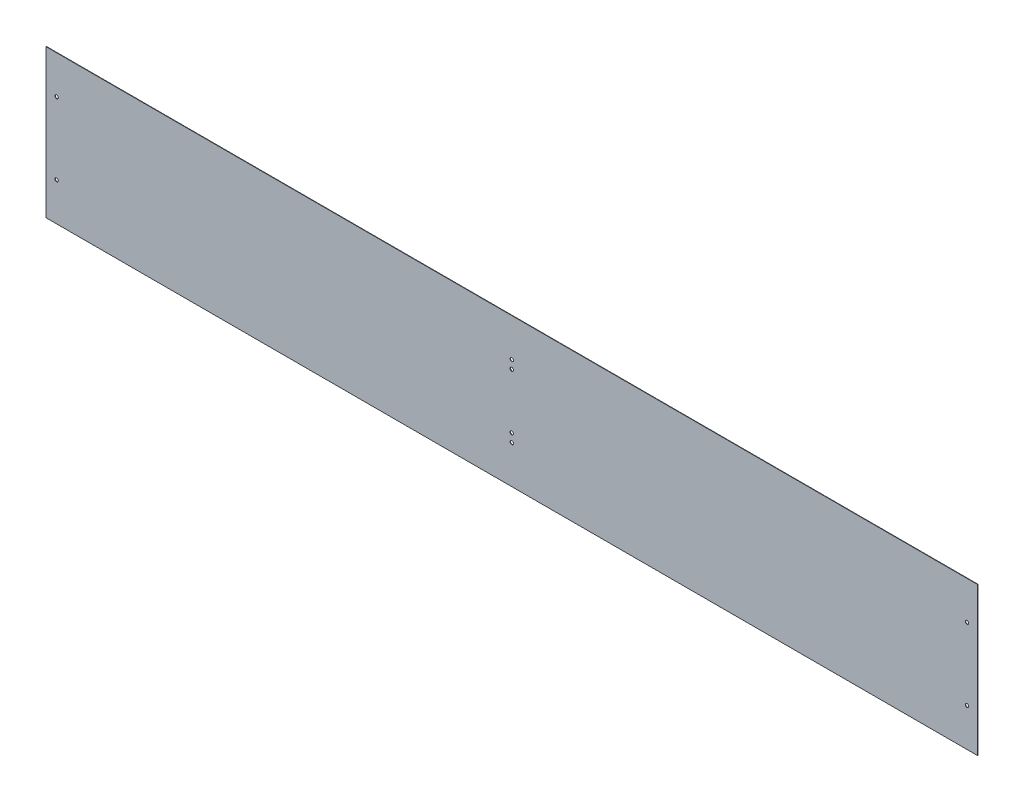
ISO-10303-21;
HEADER;
FILE_DESCRIPTION(('STEP AP214'),'2;1');
FILE_NAME('part.step','',(''),(''),'','','');
FILE_SCHEMA(('AUTOMOTIVE_DESIGN { 1 0 10303 214 1 1 1 1 }'));
ENDSEC;
DATA;
#1=APPLICATION_CONTEXT('core data for automotive mechanical design processes');
#2=APPLICATION_PROTOCOL_DEFINITION('international standard','automotive_design',2000,#1);
#3=PRODUCT_CONTEXT('',#1,'mechanical');
#4=PRODUCT('Part','Part','',(#3));
#5=PRODUCT_RELATED_PRODUCT_CATEGORY('part','',(#4));
#6=PRODUCT_DEFINITION_FORMATION('','',#4);
#7=PRODUCT_DEFINITION_CONTEXT('part definition',#1,'design');
#8=PRODUCT_DEFINITION('design','',#6,#7);
#9=PRODUCT_DEFINITION_SHAPE('','',#8);
#10=(LENGTH_UNIT() NAMED_UNIT(*) SI_UNIT(.MILLI.,.METRE.));
#11=(NAMED_UNIT(*) PLANE_ANGLE_UNIT() SI_UNIT($,.RADIAN.));
#12=(NAMED_UNIT(*) SI_UNIT($,.STERADIAN.) SOLID_ANGLE_UNIT());
#13=UNCERTAINTY_MEASURE_WITH_UNIT(LENGTH_MEASURE(1.E-05),#10,'distance_accuracy_value','');
#14=(GEOMETRIC_REPRESENTATION_CONTEXT(3) GLOBAL_UNCERTAINTY_ASSIGNED_CONTEXT((#13)) GLOBAL_UNIT_ASSIGNED_CONTEXT((#10,
#11,#12)) REPRESENTATION_CONTEXT('',''));
#15=CARTESIAN_POINT('',(0.,0.,0.));
#16=DIRECTION('',(0.,0.,1.));
#17=DIRECTION('',(1.,0.,0.));
#18=AXIS2_PLACEMENT_3D('',#15,#16,#17);
#19=CARTESIAN_POINT('',(220.,70.,-0.099999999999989));
#20=DIRECTION('',(-1.,0.,0.));
#21=DIRECTION('',(0.,0.,1.));
#22=AXIS2_PLACEMENT_3D('',#19,#20,#21);
#23=PLANE('',#22);
#24=DIRECTION('',(0.,0.,-1.));
#25=VECTOR('',#24,1.);
#26=CARTESIAN_POINT('',(220.,0.,-0.099999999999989));
#27=LINE('',#26,#25);
#28=CARTESIAN_POINT('',(220.,0.,0.099999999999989));
#29=VERTEX_POINT('',#28);
#30=CARTESIAN_POINT('',(220.,0.,-0.099999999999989));
#31=VERTEX_POINT('',#30);
#32=EDGE_CURVE('E107',#29,#31,#27,.T.);
#33=ORIENTED_EDGE('',*,*,#32,.T.);
#34=DIRECTION('',(0.,-1.,0.));
#35=VECTOR('',#34,1.);
#36=CARTESIAN_POINT('',(220.,70.,-0.099999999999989));
#37=LINE('',#36,#35);
#38=CARTESIAN_POINT('',(220.,70.,-0.099999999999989));
#39=VERTEX_POINT('',#38);
#40=EDGE_CURVE('E11',#39,#31,#37,.T.);
#41=ORIENTED_EDGE('',*,*,#40,.F.);
#42=DIRECTION('',(0.,0.,-1.));
#43=VECTOR('',#42,1.);
#44=CARTESIAN_POINT('',(220.,70.,-0.099999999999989));
#45=LINE('',#44,#43);
#46=CARTESIAN_POINT('',(220.,70.,0.099999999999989));
#47=VERTEX_POINT('',#46);
#48=EDGE_CURVE('E91',#47,#39,#45,.T.);
#49=ORIENTED_EDGE('',*,*,#48,.F.);
#50=DIRECTION('',(0.,-1.,0.));
#51=VECTOR('',#50,1.);
#52=CARTESIAN_POINT('',(220.,70.,0.099999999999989));
#53=LINE('',#52,#51);
#54=EDGE_CURVE('E103',#47,#29,#53,.T.);
#55=ORIENTED_EDGE('',*,*,#54,.T.);
#56=EDGE_LOOP('',(#33,#41,#49,#55));
#57=FACE_BOUND('',#56,.T.);
#58=ADVANCED_FACE('F39',(#57),#23,.F.);
#59=CARTESIAN_POINT('',(-220.,70.,-0.099999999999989));
#60=DIRECTION('',(0.,0.,1.));
#61=DIRECTION('',(1.,0.,0.));
#62=AXIS2_PLACEMENT_3D('',#59,#60,#61);
#63=PLANE('',#62);
#64=CARTESIAN_POINT('',(215.,52.,-0.099999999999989));
#65=DIRECTION('',(0.,0.,-1.));
#66=DIRECTION('',(-1.,0.,0.));
#67=AXIS2_PLACEMENT_3D('',#64,#65,#66);
#68=CIRCLE('',#67,0.799999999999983);
#69=CARTESIAN_POINT('',(214.2,52.,-0.099999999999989));
#70=VERTEX_POINT('',#69);
#71=EDGE_CURVE('E161',#70,#70,#68,.T.);
#72=ORIENTED_EDGE('',*,*,#71,.F.);
#73=EDGE_LOOP('',(#72));
#74=FACE_BOUND('',#73,.T.);
#75=CARTESIAN_POINT('',(0.,52.,-0.099999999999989));
#76=DIRECTION('',(0.,0.,-1.));
#77=DIRECTION('',(-1.,0.,0.));
#78=AXIS2_PLACEMENT_3D('',#75,#76,#77);
#79=CIRCLE('',#78,0.800000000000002);
#80=CARTESIAN_POINT('',(-0.800000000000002,52.,-0.099999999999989));
#81=VERTEX_POINT('',#80);
#82=EDGE_CURVE('E153',#81,#81,#79,.T.);
#83=ORIENTED_EDGE('',*,*,#82,.F.);
#84=EDGE_LOOP('',(#83));
#85=FACE_BOUND('',#84,.T.);
#86=CARTESIAN_POINT('',(0.,22.,-0.099999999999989));
#87=DIRECTION('',(0.,0.,-1.));
#88=DIRECTION('',(-1.,0.,0.));
#89=AXIS2_PLACEMENT_3D('',#86,#87,#88);
#90=CIRCLE('',#89,0.8);
#91=CARTESIAN_POINT('',(-0.8,22.,-0.099999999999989));
#92=VERTEX_POINT('',#91);
#93=EDGE_CURVE('E145',#92,#92,#90,.T.);
#94=ORIENTED_EDGE('',*,*,#93,.F.);
#95=EDGE_LOOP('',(#94));
#96=FACE_BOUND('',#95,.T.);
#97=CARTESIAN_POINT('',(0.,18.,-0.099999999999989));
#98=DIRECTION('',(0.,0.,-1.));
#99=DIRECTION('',(-1.,0.,0.));
#100=AXIS2_PLACEMENT_3D('',#97,#98,#99);
#101=CIRCLE('',#100,0.799999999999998);
#102=CARTESIAN_POINT('',(-0.799999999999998,18.,-0.099999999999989));
#103=VERTEX_POINT('',#102);
#104=EDGE_CURVE('E136',#103,#103,#101,.T.);
#105=ORIENTED_EDGE('',*,*,#104,.F.);
#106=EDGE_LOOP('',(#105));
#107=FACE_BOUND('',#106,.T.);
#108=CARTESIAN_POINT('',(0.,48.,-0.099999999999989));
#109=DIRECTION('',(0.,0.,-1.));
#110=DIRECTION('',(-1.,0.,0.));
#111=AXIS2_PLACEMENT_3D('',#108,#109,#110);
#112=CIRCLE('',#111,0.800000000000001);
#113=CARTESIAN_POINT('',(-0.800000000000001,48.,-0.099999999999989));
#114=VERTEX_POINT('',#113);
#115=EDGE_CURVE('E184',#114,#114,#112,.T.);
#116=ORIENTED_EDGE('',*,*,#115,.F.);
#117=EDGE_LOOP('',(#116));
#118=FACE_BOUND('',#117,.T.);
#119=CARTESIAN_POINT('',(-215.,18.,-0.099999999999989));
#120=DIRECTION('',(0.,0.,-1.));
#121=DIRECTION('',(1.,0.,0.));
#122=AXIS2_PLACEMENT_3D('',#119,#120,#121);
#123=CIRCLE('',#122,0.799999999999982);
#124=CARTESIAN_POINT('',(-215.8,18.,-0.099999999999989));
#125=VERTEX_POINT('',#124);
#126=EDGE_CURVE('E176',#125,#125,#123,.T.);
#127=ORIENTED_EDGE('',*,*,#126,.F.);
#128=EDGE_LOOP('',(#127));
#129=FACE_BOUND('',#128,.T.);
#130=CARTESIAN_POINT('',(-215.,52.,-0.099999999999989));
#131=DIRECTION('',(0.,0.,-1.));
#132=DIRECTION('',(1.,0.,0.));
#133=AXIS2_PLACEMENT_3D('',#130,#131,#132);
#134=CIRCLE('',#133,0.799999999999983);
#135=CARTESIAN_POINT('',(-215.8,52.,-0.099999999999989));
#136=VERTEX_POINT('',#135);
#137=EDGE_CURVE('E168',#136,#136,#134,.T.);
#138=ORIENTED_EDGE('',*,*,#137,.F.);
#139=EDGE_LOOP('',(#138));
#140=FACE_BOUND('',#139,.T.);
#141=CARTESIAN_POINT('',(215.,18.,-0.099999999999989));
#142=DIRECTION('',(0.,0.,-1.));
#143=DIRECTION('',(-1.,0.,0.));
#144=AXIS2_PLACEMENT_3D('',#141,#142,#143);
#145=CIRCLE('',#144,0.799999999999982);
#146=CARTESIAN_POINT('',(214.2,18.,-0.099999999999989));
#147=VERTEX_POINT('',#146);
#148=EDGE_CURVE('E128',#147,#147,#145,.T.);
#149=ORIENTED_EDGE('',*,*,#148,.F.);
#150=EDGE_LOOP('',(#149));
#151=FACE_BOUND('',#150,.T.);
#152=DIRECTION('',(-1.,0.,0.));
#153=VECTOR('',#152,1.);
#154=CARTESIAN_POINT('',(-220.,0.,-0.099999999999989));
#155=LINE('',#154,#153);
#156=CARTESIAN_POINT('',(-220.,0.,-0.099999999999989));
#157=VERTEX_POINT('',#156);
#158=EDGE_CURVE('E96',#31,#157,#155,.T.);
#159=ORIENTED_EDGE('',*,*,#158,.T.);
#160=DIRECTION('',(0.,-1.,0.));
#161=VECTOR('',#160,1.);
#162=CARTESIAN_POINT('',(-220.,70.,-0.099999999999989));
#163=LINE('',#162,#161);
#164=CARTESIAN_POINT('',(-220.,70.,-0.099999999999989));
#165=VERTEX_POINT('',#164);
#166=EDGE_CURVE('E48',#165,#157,#163,.T.);
#167=ORIENTED_EDGE('',*,*,#166,.F.);
#168=DIRECTION('',(-1.,0.,0.));
#169=VECTOR('',#168,1.);
#170=CARTESIAN_POINT('',(-220.,70.,-0.099999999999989));
#171=LINE('',#170,#169);
#172=EDGE_CURVE('E86',#39,#165,#171,.T.);
#173=ORIENTED_EDGE('',*,*,#172,.F.);
#174=ORIENTED_EDGE('',*,*,#40,.T.);
#175=EDGE_LOOP('',(#159,#167,#173,#174));
#176=FACE_BOUND('',#175,.T.);
#177=ADVANCED_FACE('F95',(#74,#85,#96,#107,#118,#129,#140,#151,#176),#63,.F.);
#178=CARTESIAN_POINT('',(-220.,70.,-0.099999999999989));
#179=DIRECTION('',(1.,0.,0.));
#180=DIRECTION('',(0.,0.,-1.));
#181=AXIS2_PLACEMENT_3D('',#178,#179,#180);
#182=PLANE('',#181);
#183=DIRECTION('',(0.,0.,1.));
#184=VECTOR('',#183,1.);
#185=CARTESIAN_POINT('',(-220.,0.,-0.099999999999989));
#186=LINE('',#185,#184);
#187=CARTESIAN_POINT('',(-220.,0.,0.099999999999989));
#188=VERTEX_POINT('',#187);
#189=EDGE_CURVE('E73',#157,#188,#186,.T.);
#190=ORIENTED_EDGE('',*,*,#189,.T.);
#191=DIRECTION('',(0.,-1.,0.));
#192=VECTOR('',#191,1.);
#193=CARTESIAN_POINT('',(-220.,70.,0.099999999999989));
#194=LINE('',#193,#192);
#195=CARTESIAN_POINT('',(-220.,70.,0.099999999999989));
#196=VERTEX_POINT('',#195);
#197=EDGE_CURVE('E98',#196,#188,#194,.T.);
#198=ORIENTED_EDGE('',*,*,#197,.F.);
#199=DIRECTION('',(0.,0.,1.));
#200=VECTOR('',#199,1.);
#201=CARTESIAN_POINT('',(-220.,70.,-0.099999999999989));
#202=LINE('',#201,#200);
#203=EDGE_CURVE('E89',#165,#196,#202,.T.);
#204=ORIENTED_EDGE('',*,*,#203,.F.);
#205=ORIENTED_EDGE('',*,*,#166,.T.);
#206=EDGE_LOOP('',(#190,#198,#204,#205));
#207=FACE_BOUND('',#206,.T.);
#208=ADVANCED_FACE('F99',(#207),#182,.F.);
#209=CARTESIAN_POINT('',(-220.,70.,0.099999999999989));
#210=DIRECTION('',(0.,0.,-1.));
#211=DIRECTION('',(-1.,0.,0.));
#212=AXIS2_PLACEMENT_3D('',#209,#210,#211);
#213=PLANE('',#212);
#214=CARTESIAN_POINT('',(215.,52.,0.099999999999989));
#215=DIRECTION('',(0.,0.,-1.));
#216=DIRECTION('',(-1.,0.,0.));
#217=AXIS2_PLACEMENT_3D('',#214,#215,#216);
#218=CIRCLE('',#217,0.799999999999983);
#219=CARTESIAN_POINT('',(214.2,52.,0.099999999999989));
#220=VERTEX_POINT('',#219);
#221=EDGE_CURVE('E132',#220,#220,#218,.T.);
#222=ORIENTED_EDGE('',*,*,#221,.T.);
#223=EDGE_LOOP('',(#222));
#224=FACE_BOUND('',#223,.T.);
#225=CARTESIAN_POINT('',(0.,52.,0.099999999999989));
#226=DIRECTION('',(0.,0.,-1.));
#227=DIRECTION('',(-1.,0.,0.));
#228=AXIS2_PLACEMENT_3D('',#225,#226,#227);
#229=CIRCLE('',#228,0.800000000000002);
#230=CARTESIAN_POINT('',(-0.800000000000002,52.,0.099999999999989));
#231=VERTEX_POINT('',#230);
#232=EDGE_CURVE('E157',#231,#231,#229,.T.);
#233=ORIENTED_EDGE('',*,*,#232,.T.);
#234=EDGE_LOOP('',(#233));
#235=FACE_BOUND('',#234,.T.);
#236=CARTESIAN_POINT('',(0.,22.,0.099999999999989));
#237=DIRECTION('',(0.,0.,-1.));
#238=DIRECTION('',(-1.,0.,0.));
#239=AXIS2_PLACEMENT_3D('',#236,#237,#238);
#240=CIRCLE('',#239,0.8);
#241=CARTESIAN_POINT('',(-0.8,22.,0.099999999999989));
#242=VERTEX_POINT('',#241);
#243=EDGE_CURVE('E149',#242,#242,#240,.T.);
#244=ORIENTED_EDGE('',*,*,#243,.T.);
#245=EDGE_LOOP('',(#244));
#246=FACE_BOUND('',#245,.T.);
#247=CARTESIAN_POINT('',(0.,18.,0.099999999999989));
#248=DIRECTION('',(0.,0.,-1.));
#249=DIRECTION('',(-1.,0.,0.));
#250=AXIS2_PLACEMENT_3D('',#247,#248,#249);
#251=CIRCLE('',#250,0.799999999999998);
#252=CARTESIAN_POINT('',(-0.799999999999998,18.,0.099999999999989));
#253=VERTEX_POINT('',#252);
#254=EDGE_CURVE('E140',#253,#253,#251,.T.);
#255=ORIENTED_EDGE('',*,*,#254,.T.);
#256=EDGE_LOOP('',(#255));
#257=FACE_BOUND('',#256,.T.);
#258=CARTESIAN_POINT('',(0.,48.,0.099999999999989));
#259=DIRECTION('',(0.,0.,-1.));
#260=DIRECTION('',(-1.,0.,0.));
#261=AXIS2_PLACEMENT_3D('',#258,#259,#260);
#262=CIRCLE('',#261,0.800000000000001);
#263=CARTESIAN_POINT('',(-0.800000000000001,48.,0.099999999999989));
#264=VERTEX_POINT('',#263);
#265=EDGE_CURVE('E141',#264,#264,#262,.T.);
#266=ORIENTED_EDGE('',*,*,#265,.T.);
#267=EDGE_LOOP('',(#266));
#268=FACE_BOUND('',#267,.T.);
#269=CARTESIAN_POINT('',(-215.,18.,0.099999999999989));
#270=DIRECTION('',(0.,0.,-1.));
#271=DIRECTION('',(1.,0.,0.));
#272=AXIS2_PLACEMENT_3D('',#269,#270,#271);
#273=CIRCLE('',#272,0.799999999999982);
#274=CARTESIAN_POINT('',(-215.8,18.,0.099999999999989));
#275=VERTEX_POINT('',#274);
#276=EDGE_CURVE('E180',#275,#275,#273,.T.);
#277=ORIENTED_EDGE('',*,*,#276,.T.);
#278=EDGE_LOOP('',(#277));
#279=FACE_BOUND('',#278,.T.);
#280=CARTESIAN_POINT('',(-215.,52.,0.099999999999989));
#281=DIRECTION('',(0.,0.,-1.));
#282=DIRECTION('',(1.,0.,0.));
#283=AXIS2_PLACEMENT_3D('',#280,#281,#282);
#284=CIRCLE('',#283,0.799999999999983);
#285=CARTESIAN_POINT('',(-215.8,52.,0.099999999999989));
#286=VERTEX_POINT('',#285);
#287=EDGE_CURVE('E172',#286,#286,#284,.T.);
#288=ORIENTED_EDGE('',*,*,#287,.T.);
#289=EDGE_LOOP('',(#288));
#290=FACE_BOUND('',#289,.T.);
#291=CARTESIAN_POINT('',(215.,18.,0.099999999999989));
#292=DIRECTION('',(0.,0.,-1.));
#293=DIRECTION('',(-1.,0.,0.));
#294=AXIS2_PLACEMENT_3D('',#291,#292,#293);
#295=CIRCLE('',#294,0.799999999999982);
#296=CARTESIAN_POINT('',(214.2,18.,0.099999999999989));
#297=VERTEX_POINT('',#296);
#298=EDGE_CURVE('E111',#297,#297,#295,.T.);
#299=ORIENTED_EDGE('',*,*,#298,.T.);
#300=EDGE_LOOP('',(#299));
#301=FACE_BOUND('',#300,.T.);
#302=DIRECTION('',(1.,0.,0.));
#303=VECTOR('',#302,1.);
#304=CARTESIAN_POINT('',(-220.,0.,0.099999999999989));
#305=LINE('',#304,#303);
#306=EDGE_CURVE('E79',#188,#29,#305,.T.);
#307=ORIENTED_EDGE('',*,*,#306,.T.);
#308=ORIENTED_EDGE('',*,*,#54,.F.);
#309=DIRECTION('',(1.,0.,0.));
#310=VECTOR('',#309,1.);
#311=CARTESIAN_POINT('',(-220.,70.,0.099999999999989));
#312=LINE('',#311,#310);
#313=EDGE_CURVE('E56',#196,#47,#312,.T.);
#314=ORIENTED_EDGE('',*,*,#313,.F.);
#315=ORIENTED_EDGE('',*,*,#197,.T.);
#316=EDGE_LOOP('',(#307,#308,#314,#315));
#317=FACE_BOUND('',#316,.T.);
#318=ADVANCED_FACE('F121',(#224,#235,#246,#257,#268,#279,#290,#301,#317),#213,.F.);
#319=CARTESIAN_POINT('',(0.,70.,0.));
#320=DIRECTION('',(0.,1.,0.));
#321=DIRECTION('',(0.,0.,1.));
#322=AXIS2_PLACEMENT_3D('',#319,#320,#321);
#323=PLANE('',#322);
#324=ORIENTED_EDGE('',*,*,#48,.T.);
#325=ORIENTED_EDGE('',*,*,#172,.T.);
#326=ORIENTED_EDGE('',*,*,#203,.T.);
#327=ORIENTED_EDGE('',*,*,#313,.T.);
#328=EDGE_LOOP('',(#324,#325,#326,#327));
#329=FACE_BOUND('',#328,.T.);
#330=ADVANCED_FACE('F87',(#329),#323,.T.);
#331=CARTESIAN_POINT('',(0.,0.,0.));
#332=DIRECTION('',(0.,1.,0.));
#333=DIRECTION('',(0.,0.,1.));
#334=AXIS2_PLACEMENT_3D('',#331,#332,#333);
#335=PLANE('',#334);
#336=ORIENTED_EDGE('',*,*,#32,.F.);
#337=ORIENTED_EDGE('',*,*,#306,.F.);
#338=ORIENTED_EDGE('',*,*,#189,.F.);
#339=ORIENTED_EDGE('',*,*,#158,.F.);
#340=EDGE_LOOP('',(#336,#337,#338,#339));
#341=FACE_BOUND('',#340,.T.);
#342=ADVANCED_FACE('F124',(#341),#335,.F.);
#343=CARTESIAN_POINT('',(215.,18.,0.099999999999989));
#344=DIRECTION('',(0.,0.,-1.));
#345=DIRECTION('',(-1.,0.,0.));
#346=AXIS2_PLACEMENT_3D('',#343,#344,#345);
#347=CYLINDRICAL_SURFACE('',#346,0.799999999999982);
#348=CARTESIAN_POINT('',(214.2,18.,0.099999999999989));
#349=CARTESIAN_POINT('',(214.2,18.,0.0979166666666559));
#350=CARTESIAN_POINT('',(214.2,18.,0.0958333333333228));
#351=CARTESIAN_POINT('',(214.2,18.,0.0916666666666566));
#352=CARTESIAN_POINT('',(214.2,18.,0.0895833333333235));
#353=CARTESIAN_POINT('',(214.2,18.,0.0854166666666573));
#354=CARTESIAN_POINT('',(214.2,18.,0.0833333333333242));
#355=CARTESIAN_POINT('',(214.2,18.,0.079166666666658));
#356=CARTESIAN_POINT('',(214.2,18.,0.0770833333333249));
#357=CARTESIAN_POINT('',(214.2,18.,0.0729166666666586));
#358=CARTESIAN_POINT('',(214.2,18.,0.0708333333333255));
#359=CARTESIAN_POINT('',(214.2,18.,0.0666666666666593));
#360=CARTESIAN_POINT('',(214.2,18.,0.0645833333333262));
#361=CARTESIAN_POINT('',(214.2,18.,0.06041666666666));
#362=CARTESIAN_POINT('',(214.2,18.,0.0583333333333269));
#363=CARTESIAN_POINT('',(214.2,18.,0.0541666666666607));
#364=CARTESIAN_POINT('',(214.2,18.,0.0520833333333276));
#365=CARTESIAN_POINT('',(214.2,18.,0.0479166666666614));
#366=CARTESIAN_POINT('',(214.2,18.,0.0458333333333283));
#367=CARTESIAN_POINT('',(214.2,18.,0.0416666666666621));
#368=CARTESIAN_POINT('',(214.2,18.,0.039583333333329));
#369=CARTESIAN_POINT('',(214.2,18.,0.0354166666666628));
#370=CARTESIAN_POINT('',(214.2,18.,0.0333333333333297));
#371=CARTESIAN_POINT('',(214.2,18.,0.0291666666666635));
#372=CARTESIAN_POINT('',(214.2,18.,0.0270833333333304));
#373=CARTESIAN_POINT('',(214.2,18.,0.0229166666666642));
#374=CARTESIAN_POINT('',(214.2,18.,0.0208333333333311));
#375=CARTESIAN_POINT('',(214.2,18.,0.0166666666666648));
#376=CARTESIAN_POINT('',(214.2,18.,0.0145833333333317));
#377=CARTESIAN_POINT('',(214.2,18.,0.0104166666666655));
#378=CARTESIAN_POINT('',(214.2,18.,0.00833333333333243));
#379=CARTESIAN_POINT('',(214.2,18.,0.00416666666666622));
#380=CARTESIAN_POINT('',(214.2,18.,0.00208333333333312));
#381=CARTESIAN_POINT('',(214.2,18.,-0.00208333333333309));
#382=CARTESIAN_POINT('',(214.2,18.,-0.00416666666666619));
#383=CARTESIAN_POINT('',(214.2,18.,-0.0083333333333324));
#384=CARTESIAN_POINT('',(214.2,18.,-0.0104166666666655));
#385=CARTESIAN_POINT('',(214.2,18.,-0.0145833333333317));
#386=CARTESIAN_POINT('',(214.2,18.,-0.0166666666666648));
#387=CARTESIAN_POINT('',(214.2,18.,-0.020833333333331));
#388=CARTESIAN_POINT('',(214.2,18.,-0.0229166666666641));
#389=CARTESIAN_POINT('',(214.2,18.,-0.0270833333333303));
#390=CARTESIAN_POINT('',(214.2,18.,-0.0291666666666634));
#391=CARTESIAN_POINT('',(214.2,18.,-0.0333333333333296));
#392=CARTESIAN_POINT('',(214.2,18.,-0.0354166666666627));
#393=CARTESIAN_POINT('',(214.2,18.,-0.0395833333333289));
#394=CARTESIAN_POINT('',(214.2,18.,-0.041666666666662));
#395=CARTESIAN_POINT('',(214.2,18.,-0.0458333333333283));
#396=CARTESIAN_POINT('',(214.2,18.,-0.0479166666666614));
#397=CARTESIAN_POINT('',(214.2,18.,-0.0520833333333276));
#398=CARTESIAN_POINT('',(214.2,18.,-0.0541666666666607));
#399=CARTESIAN_POINT('',(214.2,18.,-0.0583333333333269));
#400=CARTESIAN_POINT('',(214.2,18.,-0.06041666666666));
#401=CARTESIAN_POINT('',(214.2,18.,-0.0645833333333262));
#402=CARTESIAN_POINT('',(214.2,18.,-0.0666666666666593));
#403=CARTESIAN_POINT('',(214.2,18.,-0.0708333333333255));
#404=CARTESIAN_POINT('',(214.2,18.,-0.0729166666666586));
#405=CARTESIAN_POINT('',(214.2,18.,-0.0770833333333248));
#406=CARTESIAN_POINT('',(214.2,18.,-0.0791666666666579));
#407=CARTESIAN_POINT('',(214.2,18.,-0.0833333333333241));
#408=CARTESIAN_POINT('',(214.2,18.,-0.0854166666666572));
#409=CARTESIAN_POINT('',(214.2,18.,-0.0895833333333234));
#410=CARTESIAN_POINT('',(214.2,18.,-0.0916666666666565));
#411=CARTESIAN_POINT('',(214.2,18.,-0.0958333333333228));
#412=CARTESIAN_POINT('',(214.2,18.,-0.0979166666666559));
#413=CARTESIAN_POINT('',(214.2,18.,-0.099999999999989));
#414=B_SPLINE_CURVE_WITH_KNOTS('',3,(#348,#349,#350,#351,#352,#353,#354,#355,#356,#357,#358,
#359,#360,#361,#362,#363,#364,#365,#366,#367,#368,#369,#370,#371,#372,#373,#374,#375,#376,#377,
#378,#379,#380,#381,#382,#383,#384,#385,#386,#387,#388,#389,#390,#391,#392,#393,#394,#395,#396,
#397,#398,#399,#400,#401,#402,#403,#404,#405,#406,#407,#408,#409,#410,#411,#412,#413),
.UNSPECIFIED.,.F.,.F.,(4,2,2,2,2,2,2,2,2,2,2,2,2,2,2,2,2,2,2,2,2,2,2,2,2,2,2,2,2,2,2,2,4),(0.,
0.0062499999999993,0.0124999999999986,0.0187499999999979,0.0249999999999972,0.0312499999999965,
0.0374999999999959,0.0437499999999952,0.0499999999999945,0.0562499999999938,0.0624999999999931,
0.0687499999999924,0.0749999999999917,0.081249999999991,0.0874999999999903,0.0937499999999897,
0.099999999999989,0.106249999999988,0.112499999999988,0.118749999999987,0.124999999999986,
0.131249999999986,0.137499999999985,0.143749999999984,0.149999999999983,0.156249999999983,
0.162499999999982,0.168749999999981,0.174999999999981,0.18124999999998,0.187499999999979,
0.193749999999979,0.199999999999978),.UNSPECIFIED.);
#415=EDGE_CURVE('BSEAM211',#297,#147,#414,.T.);
#416=ORIENTED_EDGE('',*,*,#298,.F.);
#417=ORIENTED_EDGE('',*,*,#148,.T.);
#418=ORIENTED_EDGE('',*,*,#415,.T.);
#419=ORIENTED_EDGE('',*,*,#415,.F.);
#420=EDGE_LOOP('',(#416,#418,#417,#419));
#421=FACE_BOUND('',#420,.T.);
#422=ADVANCED_FACE('F211',(#421),#347,.F.);
#423=CARTESIAN_POINT('',(-215.,52.,0.099999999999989));
#424=DIRECTION('',(0.,0.,-1.));
#425=DIRECTION('',(-1.,0.,0.));
#426=AXIS2_PLACEMENT_3D('',#423,#424,#425);
#427=CYLINDRICAL_SURFACE('',#426,0.799999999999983);
#428=CARTESIAN_POINT('',(-215.8,52.,0.099999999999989));
#429=CARTESIAN_POINT('',(-215.8,52.,0.0979166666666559));
#430=CARTESIAN_POINT('',(-215.8,52.,0.0958333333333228));
#431=CARTESIAN_POINT('',(-215.8,52.,0.0916666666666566));
#432=CARTESIAN_POINT('',(-215.8,52.,0.0895833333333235));
#433=CARTESIAN_POINT('',(-215.8,52.,0.0854166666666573));
#434=CARTESIAN_POINT('',(-215.8,52.,0.0833333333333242));
#435=CARTESIAN_POINT('',(-215.8,52.,0.079166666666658));
#436=CARTESIAN_POINT('',(-215.8,52.,0.0770833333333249));
#437=CARTESIAN_POINT('',(-215.8,52.,0.0729166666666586));
#438=CARTESIAN_POINT('',(-215.8,52.,0.0708333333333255));
#439=CARTESIAN_POINT('',(-215.8,52.,0.0666666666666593));
#440=CARTESIAN_POINT('',(-215.8,52.,0.0645833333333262));
#441=CARTESIAN_POINT('',(-215.8,52.,0.06041666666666));
#442=CARTESIAN_POINT('',(-215.8,52.,0.0583333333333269));
#443=CARTESIAN_POINT('',(-215.8,52.,0.0541666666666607));
#444=CARTESIAN_POINT('',(-215.8,52.,0.0520833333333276));
#445=CARTESIAN_POINT('',(-215.8,52.,0.0479166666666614));
#446=CARTESIAN_POINT('',(-215.8,52.,0.0458333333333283));
#447=CARTESIAN_POINT('',(-215.8,52.,0.0416666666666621));
#448=CARTESIAN_POINT('',(-215.8,52.,0.039583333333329));
#449=CARTESIAN_POINT('',(-215.8,52.,0.0354166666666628));
#450=CARTESIAN_POINT('',(-215.8,52.,0.0333333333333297));
#451=CARTESIAN_POINT('',(-215.8,52.,0.0291666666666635));
#452=CARTESIAN_POINT('',(-215.8,52.,0.0270833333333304));
#453=CARTESIAN_POINT('',(-215.8,52.,0.0229166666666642));
#454=CARTESIAN_POINT('',(-215.8,52.,0.0208333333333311));
#455=CARTESIAN_POINT('',(-215.8,52.,0.0166666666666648));
#456=CARTESIAN_POINT('',(-215.8,52.,0.0145833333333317));
#457=CARTESIAN_POINT('',(-215.8,52.,0.0104166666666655));
#458=CARTESIAN_POINT('',(-215.8,52.,0.00833333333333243));
#459=CARTESIAN_POINT('',(-215.8,52.,0.00416666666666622));
#460=CARTESIAN_POINT('',(-215.8,52.,0.00208333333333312));
#461=CARTESIAN_POINT('',(-215.8,52.,-0.00208333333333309));
#462=CARTESIAN_POINT('',(-215.8,52.,-0.00416666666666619));
#463=CARTESIAN_POINT('',(-215.8,52.,-0.0083333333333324));
#464=CARTESIAN_POINT('',(-215.8,52.,-0.0104166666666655));
#465=CARTESIAN_POINT('',(-215.8,52.,-0.0145833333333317));
#466=CARTESIAN_POINT('',(-215.8,52.,-0.0166666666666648));
#467=CARTESIAN_POINT('',(-215.8,52.,-0.020833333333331));
#468=CARTESIAN_POINT('',(-215.8,52.,-0.0229166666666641));
#469=CARTESIAN_POINT('',(-215.8,52.,-0.0270833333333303));
#470=CARTESIAN_POINT('',(-215.8,52.,-0.0291666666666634));
#471=CARTESIAN_POINT('',(-215.8,52.,-0.0333333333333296));
#472=CARTESIAN_POINT('',(-215.8,52.,-0.0354166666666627));
#473=CARTESIAN_POINT('',(-215.8,52.,-0.0395833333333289));
#474=CARTESIAN_POINT('',(-215.8,52.,-0.041666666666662));
#475=CARTESIAN_POINT('',(-215.8,52.,-0.0458333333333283));
#476=CARTESIAN_POINT('',(-215.8,52.,-0.0479166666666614));
#477=CARTESIAN_POINT('',(-215.8,52.,-0.0520833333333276));
#478=CARTESIAN_POINT('',(-215.8,52.,-0.0541666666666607));
#479=CARTESIAN_POINT('',(-215.8,52.,-0.0583333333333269));
#480=CARTESIAN_POINT('',(-215.8,52.,-0.06041666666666));
#481=CARTESIAN_POINT('',(-215.8,52.,-0.0645833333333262));
#482=CARTESIAN_POINT('',(-215.8,52.,-0.0666666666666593));
#483=CARTESIAN_POINT('',(-215.8,52.,-0.0708333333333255));
#484=CARTESIAN_POINT('',(-215.8,52.,-0.0729166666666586));
#485=CARTESIAN_POINT('',(-215.8,52.,-0.0770833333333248));
#486=CARTESIAN_POINT('',(-215.8,52.,-0.0791666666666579));
#487=CARTESIAN_POINT('',(-215.8,52.,-0.0833333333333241));
#488=CARTESIAN_POINT('',(-215.8,52.,-0.0854166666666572));
#489=CARTESIAN_POINT('',(-215.8,52.,-0.0895833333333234));
#490=CARTESIAN_POINT('',(-215.8,52.,-0.0916666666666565));
#491=CARTESIAN_POINT('',(-215.8,52.,-0.0958333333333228));
#492=CARTESIAN_POINT('',(-215.8,52.,-0.0979166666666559));
#493=CARTESIAN_POINT('',(-215.8,52.,-0.099999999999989));
#494=B_SPLINE_CURVE_WITH_KNOTS('',3,(#428,#429,#430,#431,#432,#433,#434,#435,#436,#437,#438,
#439,#440,#441,#442,#443,#444,#445,#446,#447,#448,#449,#450,#451,#452,#453,#454,#455,#456,#457,
#458,#459,#460,#461,#462,#463,#464,#465,#466,#467,#468,#469,#470,#471,#472,#473,#474,#475,#476,
#477,#478,#479,#480,#481,#482,#483,#484,#485,#486,#487,#488,#489,#490,#491,#492,#493),
.UNSPECIFIED.,.F.,.F.,(4,2,2,2,2,2,2,2,2,2,2,2,2,2,2,2,2,2,2,2,2,2,2,2,2,2,2,2,2,2,2,2,4),(0.,
0.0062499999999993,0.0124999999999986,0.0187499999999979,0.0249999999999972,0.0312499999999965,
0.0374999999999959,0.0437499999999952,0.0499999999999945,0.0562499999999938,0.0624999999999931,
0.0687499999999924,0.0749999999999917,0.081249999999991,0.0874999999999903,0.0937499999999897,
0.099999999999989,0.106249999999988,0.112499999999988,0.118749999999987,0.124999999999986,
0.131249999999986,0.137499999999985,0.143749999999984,0.149999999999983,0.156249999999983,
0.162499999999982,0.168749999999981,0.174999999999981,0.18124999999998,0.187499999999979,
0.193749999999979,0.199999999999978),.UNSPECIFIED.);
#495=EDGE_CURVE('BSEAM213',#286,#136,#494,.T.);
#496=ORIENTED_EDGE('',*,*,#287,.F.);
#497=ORIENTED_EDGE('',*,*,#137,.T.);
#498=ORIENTED_EDGE('',*,*,#495,.T.);
#499=ORIENTED_EDGE('',*,*,#495,.F.);
#500=EDGE_LOOP('',(#496,#498,#497,#499));
#501=FACE_BOUND('',#500,.T.);
#502=ADVANCED_FACE('F213',(#501),#427,.F.);
#503=CARTESIAN_POINT('',(-215.,18.,0.099999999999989));
#504=DIRECTION('',(0.,0.,-1.));
#505=DIRECTION('',(-1.,0.,0.));
#506=AXIS2_PLACEMENT_3D('',#503,#504,#505);
#507=CYLINDRICAL_SURFACE('',#506,0.799999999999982);
#508=CARTESIAN_POINT('',(-215.8,18.,0.099999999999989));
#509=CARTESIAN_POINT('',(-215.8,18.,0.0979166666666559));
#510=CARTESIAN_POINT('',(-215.8,18.,0.0958333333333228));
#511=CARTESIAN_POINT('',(-215.8,18.,0.0916666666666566));
#512=CARTESIAN_POINT('',(-215.8,18.,0.0895833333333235));
#513=CARTESIAN_POINT('',(-215.8,18.,0.0854166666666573));
#514=CARTESIAN_POINT('',(-215.8,18.,0.0833333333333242));
#515=CARTESIAN_POINT('',(-215.8,18.,0.079166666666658));
#516=CARTESIAN_POINT('',(-215.8,18.,0.0770833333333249));
#517=CARTESIAN_POINT('',(-215.8,18.,0.0729166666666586));
#518=CARTESIAN_POINT('',(-215.8,18.,0.0708333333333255));
#519=CARTESIAN_POINT('',(-215.8,18.,0.0666666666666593));
#520=CARTESIAN_POINT('',(-215.8,18.,0.0645833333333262));
#521=CARTESIAN_POINT('',(-215.8,18.,0.06041666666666));
#522=CARTESIAN_POINT('',(-215.8,18.,0.0583333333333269));
#523=CARTESIAN_POINT('',(-215.8,18.,0.0541666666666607));
#524=CARTESIAN_POINT('',(-215.8,18.,0.0520833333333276));
#525=CARTESIAN_POINT('',(-215.8,18.,0.0479166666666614));
#526=CARTESIAN_POINT('',(-215.8,18.,0.0458333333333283));
#527=CARTESIAN_POINT('',(-215.8,18.,0.0416666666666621));
#528=CARTESIAN_POINT('',(-215.8,18.,0.039583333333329));
#529=CARTESIAN_POINT('',(-215.8,18.,0.0354166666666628));
#530=CARTESIAN_POINT('',(-215.8,18.,0.0333333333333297));
#531=CARTESIAN_POINT('',(-215.8,18.,0.0291666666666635));
#532=CARTESIAN_POINT('',(-215.8,18.,0.0270833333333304));
#533=CARTESIAN_POINT('',(-215.8,18.,0.0229166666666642));
#534=CARTESIAN_POINT('',(-215.8,18.,0.0208333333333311));
#535=CARTESIAN_POINT('',(-215.8,18.,0.0166666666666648));
#536=CARTESIAN_POINT('',(-215.8,18.,0.0145833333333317));
#537=CARTESIAN_POINT('',(-215.8,18.,0.0104166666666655));
#538=CARTESIAN_POINT('',(-215.8,18.,0.00833333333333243));
#539=CARTESIAN_POINT('',(-215.8,18.,0.00416666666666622));
#540=CARTESIAN_POINT('',(-215.8,18.,0.00208333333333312));
#541=CARTESIAN_POINT('',(-215.8,18.,-0.00208333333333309));
#542=CARTESIAN_POINT('',(-215.8,18.,-0.00416666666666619));
#543=CARTESIAN_POINT('',(-215.8,18.,-0.0083333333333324));
#544=CARTESIAN_POINT('',(-215.8,18.,-0.0104166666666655));
#545=CARTESIAN_POINT('',(-215.8,18.,-0.0145833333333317));
#546=CARTESIAN_POINT('',(-215.8,18.,-0.0166666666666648));
#547=CARTESIAN_POINT('',(-215.8,18.,-0.020833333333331));
#548=CARTESIAN_POINT('',(-215.8,18.,-0.0229166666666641));
#549=CARTESIAN_POINT('',(-215.8,18.,-0.0270833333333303));
#550=CARTESIAN_POINT('',(-215.8,18.,-0.0291666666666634));
#551=CARTESIAN_POINT('',(-215.8,18.,-0.0333333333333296));
#552=CARTESIAN_POINT('',(-215.8,18.,-0.0354166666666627));
#553=CARTESIAN_POINT('',(-215.8,18.,-0.0395833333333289));
#554=CARTESIAN_POINT('',(-215.8,18.,-0.041666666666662));
#555=CARTESIAN_POINT('',(-215.8,18.,-0.0458333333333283));
#556=CARTESIAN_POINT('',(-215.8,18.,-0.0479166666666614));
#557=CARTESIAN_POINT('',(-215.8,18.,-0.0520833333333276));
#558=CARTESIAN_POINT('',(-215.8,18.,-0.0541666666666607));
#559=CARTESIAN_POINT('',(-215.8,18.,-0.0583333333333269));
#560=CARTESIAN_POINT('',(-215.8,18.,-0.06041666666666));
#561=CARTESIAN_POINT('',(-215.8,18.,-0.0645833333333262));
#562=CARTESIAN_POINT('',(-215.8,18.,-0.0666666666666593));
#563=CARTESIAN_POINT('',(-215.8,18.,-0.0708333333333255));
#564=CARTESIAN_POINT('',(-215.8,18.,-0.0729166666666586));
#565=CARTESIAN_POINT('',(-215.8,18.,-0.0770833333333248));
#566=CARTESIAN_POINT('',(-215.8,18.,-0.0791666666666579));
#567=CARTESIAN_POINT('',(-215.8,18.,-0.0833333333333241));
#568=CARTESIAN_POINT('',(-215.8,18.,-0.0854166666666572));
#569=CARTESIAN_POINT('',(-215.8,18.,-0.0895833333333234));
#570=CARTESIAN_POINT('',(-215.8,18.,-0.0916666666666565));
#571=CARTESIAN_POINT('',(-215.8,18.,-0.0958333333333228));
#572=CARTESIAN_POINT('',(-215.8,18.,-0.0979166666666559));
#573=CARTESIAN_POINT('',(-215.8,18.,-0.099999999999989));
#574=B_SPLINE_CURVE_WITH_KNOTS('',3,(#508,#509,#510,#511,#512,#513,#514,#515,#516,#517,#518,
#519,#520,#521,#522,#523,#524,#525,#526,#527,#528,#529,#530,#531,#532,#533,#534,#535,#536,#537,
#538,#539,#540,#541,#542,#543,#544,#545,#546,#547,#548,#549,#550,#551,#552,#553,#554,#555,#556,
#557,#558,#559,#560,#561,#562,#563,#564,#565,#566,#567,#568,#569,#570,#571,#572,#573),
.UNSPECIFIED.,.F.,.F.,(4,2,2,2,2,2,2,2,2,2,2,2,2,2,2,2,2,2,2,2,2,2,2,2,2,2,2,2,2,2,2,2,4),(0.,
0.0062499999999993,0.0124999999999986,0.0187499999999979,0.0249999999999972,0.0312499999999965,
0.0374999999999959,0.0437499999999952,0.0499999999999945,0.0562499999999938,0.0624999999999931,
0.0687499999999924,0.0749999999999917,0.081249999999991,0.0874999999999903,0.0937499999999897,
0.099999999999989,0.106249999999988,0.112499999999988,0.118749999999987,0.124999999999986,
0.131249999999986,0.137499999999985,0.143749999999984,0.149999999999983,0.156249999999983,
0.162499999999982,0.168749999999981,0.174999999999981,0.18124999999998,0.187499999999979,
0.193749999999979,0.199999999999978),.UNSPECIFIED.);
#575=EDGE_CURVE('BSEAM198',#275,#125,#574,.T.);
#576=ORIENTED_EDGE('',*,*,#276,.F.);
#577=ORIENTED_EDGE('',*,*,#126,.T.);
#578=ORIENTED_EDGE('',*,*,#575,.T.);
#579=ORIENTED_EDGE('',*,*,#575,.F.);
#580=EDGE_LOOP('',(#576,#578,#577,#579));
#581=FACE_BOUND('',#580,.T.);
#582=ADVANCED_FACE('F198',(#581),#507,.F.);
#583=CARTESIAN_POINT('',(0.,48.,0.099999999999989));
#584=DIRECTION('',(0.,0.,-1.));
#585=DIRECTION('',(-1.,0.,0.));
#586=AXIS2_PLACEMENT_3D('',#583,#584,#585);
#587=CYLINDRICAL_SURFACE('',#586,0.800000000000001);
#588=CARTESIAN_POINT('',(-0.800000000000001,48.,0.099999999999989));
#589=CARTESIAN_POINT('',(-0.800000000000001,48.,0.0979166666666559));
#590=CARTESIAN_POINT('',(-0.800000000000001,48.,0.0958333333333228));
#591=CARTESIAN_POINT('',(-0.800000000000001,48.,0.0916666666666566));
#592=CARTESIAN_POINT('',(-0.800000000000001,48.,0.0895833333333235));
#593=CARTESIAN_POINT('',(-0.800000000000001,48.,0.0854166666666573));
#594=CARTESIAN_POINT('',(-0.800000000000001,48.,0.0833333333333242));
#595=CARTESIAN_POINT('',(-0.800000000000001,48.,0.079166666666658));
#596=CARTESIAN_POINT('',(-0.800000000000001,48.,0.0770833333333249));
#597=CARTESIAN_POINT('',(-0.800000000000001,48.,0.0729166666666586));
#598=CARTESIAN_POINT('',(-0.800000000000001,48.,0.0708333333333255));
#599=CARTESIAN_POINT('',(-0.800000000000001,48.,0.0666666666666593));
#600=CARTESIAN_POINT('',(-0.800000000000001,48.,0.0645833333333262));
#601=CARTESIAN_POINT('',(-0.800000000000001,48.,0.06041666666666));
#602=CARTESIAN_POINT('',(-0.800000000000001,48.,0.0583333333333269));
#603=CARTESIAN_POINT('',(-0.800000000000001,48.,0.0541666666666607));
#604=CARTESIAN_POINT('',(-0.800000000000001,48.,0.0520833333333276));
#605=CARTESIAN_POINT('',(-0.800000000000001,48.,0.0479166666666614));
#606=CARTESIAN_POINT('',(-0.800000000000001,48.,0.0458333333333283));
#607=CARTESIAN_POINT('',(-0.800000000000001,48.,0.0416666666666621));
#608=CARTESIAN_POINT('',(-0.800000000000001,48.,0.039583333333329));
#609=CARTESIAN_POINT('',(-0.800000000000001,48.,0.0354166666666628));
#610=CARTESIAN_POINT('',(-0.800000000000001,48.,0.0333333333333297));
#611=CARTESIAN_POINT('',(-0.800000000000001,48.,0.0291666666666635));
#612=CARTESIAN_POINT('',(-0.800000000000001,48.,0.0270833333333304));
#613=CARTESIAN_POINT('',(-0.800000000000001,48.,0.0229166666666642));
#614=CARTESIAN_POINT('',(-0.800000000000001,48.,0.0208333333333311));
#615=CARTESIAN_POINT('',(-0.800000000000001,48.,0.0166666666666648));
#616=CARTESIAN_POINT('',(-0.800000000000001,48.,0.0145833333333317));
#617=CARTESIAN_POINT('',(-0.800000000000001,48.,0.0104166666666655));
#618=CARTESIAN_POINT('',(-0.800000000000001,48.,0.00833333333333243));
#619=CARTESIAN_POINT('',(-0.800000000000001,48.,0.00416666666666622));
#620=CARTESIAN_POINT('',(-0.800000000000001,48.,0.00208333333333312));
#621=CARTESIAN_POINT('',(-0.800000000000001,48.,-0.00208333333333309));
#622=CARTESIAN_POINT('',(-0.800000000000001,48.,-0.00416666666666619));
#623=CARTESIAN_POINT('',(-0.800000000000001,48.,-0.0083333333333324));
#624=CARTESIAN_POINT('',(-0.800000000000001,48.,-0.0104166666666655));
#625=CARTESIAN_POINT('',(-0.800000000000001,48.,-0.0145833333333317));
#626=CARTESIAN_POINT('',(-0.800000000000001,48.,-0.0166666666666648));
#627=CARTESIAN_POINT('',(-0.800000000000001,48.,-0.020833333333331));
#628=CARTESIAN_POINT('',(-0.800000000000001,48.,-0.0229166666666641));
#629=CARTESIAN_POINT('',(-0.800000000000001,48.,-0.0270833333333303));
#630=CARTESIAN_POINT('',(-0.800000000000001,48.,-0.0291666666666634));
#631=CARTESIAN_POINT('',(-0.800000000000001,48.,-0.0333333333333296));
#632=CARTESIAN_POINT('',(-0.800000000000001,48.,-0.0354166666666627));
#633=CARTESIAN_POINT('',(-0.800000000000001,48.,-0.0395833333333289));
#634=CARTESIAN_POINT('',(-0.800000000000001,48.,-0.041666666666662));
#635=CARTESIAN_POINT('',(-0.800000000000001,48.,-0.0458333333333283));
#636=CARTESIAN_POINT('',(-0.800000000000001,48.,-0.0479166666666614));
#637=CARTESIAN_POINT('',(-0.800000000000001,48.,-0.0520833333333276));
#638=CARTESIAN_POINT('',(-0.800000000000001,48.,-0.0541666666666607));
#639=CARTESIAN_POINT('',(-0.800000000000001,48.,-0.0583333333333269));
#640=CARTESIAN_POINT('',(-0.800000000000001,48.,-0.06041666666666));
#641=CARTESIAN_POINT('',(-0.800000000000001,48.,-0.0645833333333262));
#642=CARTESIAN_POINT('',(-0.800000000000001,48.,-0.0666666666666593));
#643=CARTESIAN_POINT('',(-0.800000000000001,48.,-0.0708333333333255));
#644=CARTESIAN_POINT('',(-0.800000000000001,48.,-0.0729166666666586));
#645=CARTESIAN_POINT('',(-0.800000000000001,48.,-0.0770833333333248));
#646=CARTESIAN_POINT('',(-0.800000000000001,48.,-0.0791666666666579));
#647=CARTESIAN_POINT('',(-0.800000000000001,48.,-0.0833333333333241));
#648=CARTESIAN_POINT('',(-0.800000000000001,48.,-0.0854166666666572));
#649=CARTESIAN_POINT('',(-0.800000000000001,48.,-0.0895833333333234));
#650=CARTESIAN_POINT('',(-0.800000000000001,48.,-0.0916666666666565));
#651=CARTESIAN_POINT('',(-0.800000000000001,48.,-0.0958333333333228));
#652=CARTESIAN_POINT('',(-0.800000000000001,48.,-0.0979166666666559));
#653=CARTESIAN_POINT('',(-0.800000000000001,48.,-0.099999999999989));
#654=B_SPLINE_CURVE_WITH_KNOTS('',3,(#588,#589,#590,#591,#592,#593,#594,#595,#596,#597,#598,
#599,#600,#601,#602,#603,#604,#605,#606,#607,#608,#609,#610,#611,#612,#613,#614,#615,#616,#617,
#618,#619,#620,#621,#622,#623,#624,#625,#626,#627,#628,#629,#630,#631,#632,#633,#634,#635,#636,
#637,#638,#639,#640,#641,#642,#643,#644,#645,#646,#647,#648,#649,#650,#651,#652,#653),
.UNSPECIFIED.,.F.,.F.,(4,2,2,2,2,2,2,2,2,2,2,2,2,2,2,2,2,2,2,2,2,2,2,2,2,2,2,2,2,2,2,2,4),(0.,
0.0062499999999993,0.0124999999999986,0.0187499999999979,0.0249999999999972,0.0312499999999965,
0.0374999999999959,0.0437499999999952,0.0499999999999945,0.0562499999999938,0.0624999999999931,
0.0687499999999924,0.0749999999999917,0.081249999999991,0.0874999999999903,0.0937499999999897,
0.099999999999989,0.106249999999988,0.112499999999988,0.118749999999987,0.124999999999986,
0.131249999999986,0.137499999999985,0.143749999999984,0.149999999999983,0.156249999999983,
0.162499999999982,0.168749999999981,0.174999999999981,0.18124999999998,0.187499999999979,
0.193749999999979,0.199999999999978),.UNSPECIFIED.);
#655=EDGE_CURVE('BSEAM194',#264,#114,#654,.T.);
#656=ORIENTED_EDGE('',*,*,#265,.F.);
#657=ORIENTED_EDGE('',*,*,#115,.T.);
#658=ORIENTED_EDGE('',*,*,#655,.T.);
#659=ORIENTED_EDGE('',*,*,#655,.F.);
#660=EDGE_LOOP('',(#656,#658,#657,#659));
#661=FACE_BOUND('',#660,.T.);
#662=ADVANCED_FACE('F194',(#661),#587,.F.);
#663=CARTESIAN_POINT('',(0.,18.,0.099999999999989));
#664=DIRECTION('',(0.,0.,-1.));
#665=DIRECTION('',(-1.,0.,0.));
#666=AXIS2_PLACEMENT_3D('',#663,#664,#665);
#667=CYLINDRICAL_SURFACE('',#666,0.799999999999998);
#668=CARTESIAN_POINT('',(-0.799999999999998,18.,0.099999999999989));
#669=CARTESIAN_POINT('',(-0.799999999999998,18.,0.0979166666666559));
#670=CARTESIAN_POINT('',(-0.799999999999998,18.,0.0958333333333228));
#671=CARTESIAN_POINT('',(-0.799999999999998,18.,0.0916666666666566));
#672=CARTESIAN_POINT('',(-0.799999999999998,18.,0.0895833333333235));
#673=CARTESIAN_POINT('',(-0.799999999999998,18.,0.0854166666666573));
#674=CARTESIAN_POINT('',(-0.799999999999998,18.,0.0833333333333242));
#675=CARTESIAN_POINT('',(-0.799999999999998,18.,0.079166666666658));
#676=CARTESIAN_POINT('',(-0.799999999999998,18.,0.0770833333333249));
#677=CARTESIAN_POINT('',(-0.799999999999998,18.,0.0729166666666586));
#678=CARTESIAN_POINT('',(-0.799999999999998,18.,0.0708333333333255));
#679=CARTESIAN_POINT('',(-0.799999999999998,18.,0.0666666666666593));
#680=CARTESIAN_POINT('',(-0.799999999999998,18.,0.0645833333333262));
#681=CARTESIAN_POINT('',(-0.799999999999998,18.,0.06041666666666));
#682=CARTESIAN_POINT('',(-0.799999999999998,18.,0.0583333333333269));
#683=CARTESIAN_POINT('',(-0.799999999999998,18.,0.0541666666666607));
#684=CARTESIAN_POINT('',(-0.799999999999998,18.,0.0520833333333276));
#685=CARTESIAN_POINT('',(-0.799999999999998,18.,0.0479166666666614));
#686=CARTESIAN_POINT('',(-0.799999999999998,18.,0.0458333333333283));
#687=CARTESIAN_POINT('',(-0.799999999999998,18.,0.0416666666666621));
#688=CARTESIAN_POINT('',(-0.799999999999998,18.,0.039583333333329));
#689=CARTESIAN_POINT('',(-0.799999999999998,18.,0.0354166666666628));
#690=CARTESIAN_POINT('',(-0.799999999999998,18.,0.0333333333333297));
#691=CARTESIAN_POINT('',(-0.799999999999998,18.,0.0291666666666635));
#692=CARTESIAN_POINT('',(-0.799999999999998,18.,0.0270833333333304));
#693=CARTESIAN_POINT('',(-0.799999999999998,18.,0.0229166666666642));
#694=CARTESIAN_POINT('',(-0.799999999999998,18.,0.0208333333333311));
#695=CARTESIAN_POINT('',(-0.799999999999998,18.,0.0166666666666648));
#696=CARTESIAN_POINT('',(-0.799999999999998,18.,0.0145833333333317));
#697=CARTESIAN_POINT('',(-0.799999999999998,18.,0.0104166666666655));
#698=CARTESIAN_POINT('',(-0.799999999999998,18.,0.00833333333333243));
#699=CARTESIAN_POINT('',(-0.799999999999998,18.,0.00416666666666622));
#700=CARTESIAN_POINT('',(-0.799999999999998,18.,0.00208333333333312));
#701=CARTESIAN_POINT('',(-0.799999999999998,18.,-0.00208333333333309));
#702=CARTESIAN_POINT('',(-0.799999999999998,18.,-0.00416666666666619));
#703=CARTESIAN_POINT('',(-0.799999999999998,18.,-0.0083333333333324));
#704=CARTESIAN_POINT('',(-0.799999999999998,18.,-0.0104166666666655));
#705=CARTESIAN_POINT('',(-0.799999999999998,18.,-0.0145833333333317));
#706=CARTESIAN_POINT('',(-0.799999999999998,18.,-0.0166666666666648));
#707=CARTESIAN_POINT('',(-0.799999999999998,18.,-0.020833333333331));
#708=CARTESIAN_POINT('',(-0.799999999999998,18.,-0.0229166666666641));
#709=CARTESIAN_POINT('',(-0.799999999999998,18.,-0.0270833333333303));
#710=CARTESIAN_POINT('',(-0.799999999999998,18.,-0.0291666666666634));
#711=CARTESIAN_POINT('',(-0.799999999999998,18.,-0.0333333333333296));
#712=CARTESIAN_POINT('',(-0.799999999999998,18.,-0.0354166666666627));
#713=CARTESIAN_POINT('',(-0.799999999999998,18.,-0.0395833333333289));
#714=CARTESIAN_POINT('',(-0.799999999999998,18.,-0.041666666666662));
#715=CARTESIAN_POINT('',(-0.799999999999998,18.,-0.0458333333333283));
#716=CARTESIAN_POINT('',(-0.799999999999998,18.,-0.0479166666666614));
#717=CARTESIAN_POINT('',(-0.799999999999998,18.,-0.0520833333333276));
#718=CARTESIAN_POINT('',(-0.799999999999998,18.,-0.0541666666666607));
#719=CARTESIAN_POINT('',(-0.799999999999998,18.,-0.0583333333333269));
#720=CARTESIAN_POINT('',(-0.799999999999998,18.,-0.06041666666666));
#721=CARTESIAN_POINT('',(-0.799999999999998,18.,-0.0645833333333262));
#722=CARTESIAN_POINT('',(-0.799999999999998,18.,-0.0666666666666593));
#723=CARTESIAN_POINT('',(-0.799999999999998,18.,-0.0708333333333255));
#724=CARTESIAN_POINT('',(-0.799999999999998,18.,-0.0729166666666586));
#725=CARTESIAN_POINT('',(-0.799999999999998,18.,-0.0770833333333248));
#726=CARTESIAN_POINT('',(-0.799999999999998,18.,-0.0791666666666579));
#727=CARTESIAN_POINT('',(-0.799999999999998,18.,-0.0833333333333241));
#728=CARTESIAN_POINT('',(-0.799999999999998,18.,-0.0854166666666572));
#729=CARTESIAN_POINT('',(-0.799999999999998,18.,-0.0895833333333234));
#730=CARTESIAN_POINT('',(-0.799999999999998,18.,-0.0916666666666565));
#731=CARTESIAN_POINT('',(-0.799999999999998,18.,-0.0958333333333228));
#732=CARTESIAN_POINT('',(-0.799999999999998,18.,-0.0979166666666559));
#733=CARTESIAN_POINT('',(-0.799999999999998,18.,-0.099999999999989));
#734=B_SPLINE_CURVE_WITH_KNOTS('',3,(#668,#669,#670,#671,#672,#673,#674,#675,#676,#677,#678,
#679,#680,#681,#682,#683,#684,#685,#686,#687,#688,#689,#690,#691,#692,#693,#694,#695,#696,#697,
#698,#699,#700,#701,#702,#703,#704,#705,#706,#707,#708,#709,#710,#711,#712,#713,#714,#715,#716,
#717,#718,#719,#720,#721,#722,#723,#724,#725,#726,#727,#728,#729,#730,#731,#732,#733),
.UNSPECIFIED.,.F.,.F.,(4,2,2,2,2,2,2,2,2,2,2,2,2,2,2,2,2,2,2,2,2,2,2,2,2,2,2,2,2,2,2,2,4),(0.,
0.0062499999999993,0.0124999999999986,0.0187499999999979,0.0249999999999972,0.0312499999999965,
0.0374999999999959,0.0437499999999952,0.0499999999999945,0.0562499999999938,0.0624999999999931,
0.0687499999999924,0.0749999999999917,0.081249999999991,0.0874999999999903,0.0937499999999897,
0.099999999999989,0.106249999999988,0.112499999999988,0.118749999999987,0.124999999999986,
0.131249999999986,0.137499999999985,0.143749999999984,0.149999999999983,0.156249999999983,
0.162499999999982,0.168749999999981,0.174999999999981,0.18124999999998,0.187499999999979,
0.193749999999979,0.199999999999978),.UNSPECIFIED.);
#735=EDGE_CURVE('BSEAM197',#253,#103,#734,.T.);
#736=ORIENTED_EDGE('',*,*,#254,.F.);
#737=ORIENTED_EDGE('',*,*,#104,.T.);
#738=ORIENTED_EDGE('',*,*,#735,.T.);
#739=ORIENTED_EDGE('',*,*,#735,.F.);
#740=EDGE_LOOP('',(#736,#738,#737,#739));
#741=FACE_BOUND('',#740,.T.);
#742=ADVANCED_FACE('F197',(#741),#667,.F.);
#743=CARTESIAN_POINT('',(0.,22.,0.099999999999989));
#744=DIRECTION('',(0.,0.,-1.));
#745=DIRECTION('',(-1.,0.,0.));
#746=AXIS2_PLACEMENT_3D('',#743,#744,#745);
#747=CYLINDRICAL_SURFACE('',#746,0.8);
#748=CARTESIAN_POINT('',(-0.8,22.,0.099999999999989));
#749=CARTESIAN_POINT('',(-0.8,22.,0.0979166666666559));
#750=CARTESIAN_POINT('',(-0.8,22.,0.0958333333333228));
#751=CARTESIAN_POINT('',(-0.8,22.,0.0916666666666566));
#752=CARTESIAN_POINT('',(-0.8,22.,0.0895833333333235));
#753=CARTESIAN_POINT('',(-0.8,22.,0.0854166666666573));
#754=CARTESIAN_POINT('',(-0.8,22.,0.0833333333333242));
#755=CARTESIAN_POINT('',(-0.8,22.,0.079166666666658));
#756=CARTESIAN_POINT('',(-0.8,22.,0.0770833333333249));
#757=CARTESIAN_POINT('',(-0.8,22.,0.0729166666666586));
#758=CARTESIAN_POINT('',(-0.8,22.,0.0708333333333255));
#759=CARTESIAN_POINT('',(-0.8,22.,0.0666666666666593));
#760=CARTESIAN_POINT('',(-0.8,22.,0.0645833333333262));
#761=CARTESIAN_POINT('',(-0.8,22.,0.06041666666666));
#762=CARTESIAN_POINT('',(-0.8,22.,0.0583333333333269));
#763=CARTESIAN_POINT('',(-0.8,22.,0.0541666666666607));
#764=CARTESIAN_POINT('',(-0.8,22.,0.0520833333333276));
#765=CARTESIAN_POINT('',(-0.8,22.,0.0479166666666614));
#766=CARTESIAN_POINT('',(-0.8,22.,0.0458333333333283));
#767=CARTESIAN_POINT('',(-0.8,22.,0.0416666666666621));
#768=CARTESIAN_POINT('',(-0.8,22.,0.039583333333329));
#769=CARTESIAN_POINT('',(-0.8,22.,0.0354166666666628));
#770=CARTESIAN_POINT('',(-0.8,22.,0.0333333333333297));
#771=CARTESIAN_POINT('',(-0.8,22.,0.0291666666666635));
#772=CARTESIAN_POINT('',(-0.8,22.,0.0270833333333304));
#773=CARTESIAN_POINT('',(-0.8,22.,0.0229166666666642));
#774=CARTESIAN_POINT('',(-0.8,22.,0.0208333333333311));
#775=CARTESIAN_POINT('',(-0.8,22.,0.0166666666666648));
#776=CARTESIAN_POINT('',(-0.8,22.,0.0145833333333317));
#777=CARTESIAN_POINT('',(-0.8,22.,0.0104166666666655));
#778=CARTESIAN_POINT('',(-0.8,22.,0.00833333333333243));
#779=CARTESIAN_POINT('',(-0.8,22.,0.00416666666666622));
#780=CARTESIAN_POINT('',(-0.8,22.,0.00208333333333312));
#781=CARTESIAN_POINT('',(-0.8,22.,-0.00208333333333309));
#782=CARTESIAN_POINT('',(-0.8,22.,-0.00416666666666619));
#783=CARTESIAN_POINT('',(-0.8,22.,-0.0083333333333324));
#784=CARTESIAN_POINT('',(-0.8,22.,-0.0104166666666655));
#785=CARTESIAN_POINT('',(-0.8,22.,-0.0145833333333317));
#786=CARTESIAN_POINT('',(-0.8,22.,-0.0166666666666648));
#787=CARTESIAN_POINT('',(-0.8,22.,-0.020833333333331));
#788=CARTESIAN_POINT('',(-0.8,22.,-0.0229166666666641));
#789=CARTESIAN_POINT('',(-0.8,22.,-0.0270833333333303));
#790=CARTESIAN_POINT('',(-0.8,22.,-0.0291666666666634));
#791=CARTESIAN_POINT('',(-0.8,22.,-0.0333333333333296));
#792=CARTESIAN_POINT('',(-0.8,22.,-0.0354166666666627));
#793=CARTESIAN_POINT('',(-0.8,22.,-0.0395833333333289));
#794=CARTESIAN_POINT('',(-0.8,22.,-0.041666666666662));
#795=CARTESIAN_POINT('',(-0.8,22.,-0.0458333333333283));
#796=CARTESIAN_POINT('',(-0.8,22.,-0.0479166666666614));
#797=CARTESIAN_POINT('',(-0.8,22.,-0.0520833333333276));
#798=CARTESIAN_POINT('',(-0.8,22.,-0.0541666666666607));
#799=CARTESIAN_POINT('',(-0.8,22.,-0.0583333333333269));
#800=CARTESIAN_POINT('',(-0.8,22.,-0.06041666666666));
#801=CARTESIAN_POINT('',(-0.8,22.,-0.0645833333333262));
#802=CARTESIAN_POINT('',(-0.8,22.,-0.0666666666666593));
#803=CARTESIAN_POINT('',(-0.8,22.,-0.0708333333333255));
#804=CARTESIAN_POINT('',(-0.8,22.,-0.0729166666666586));
#805=CARTESIAN_POINT('',(-0.8,22.,-0.0770833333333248));
#806=CARTESIAN_POINT('',(-0.8,22.,-0.0791666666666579));
#807=CARTESIAN_POINT('',(-0.8,22.,-0.0833333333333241));
#808=CARTESIAN_POINT('',(-0.8,22.,-0.0854166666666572));
#809=CARTESIAN_POINT('',(-0.8,22.,-0.0895833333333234));
#810=CARTESIAN_POINT('',(-0.8,22.,-0.0916666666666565));
#811=CARTESIAN_POINT('',(-0.8,22.,-0.0958333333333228));
#812=CARTESIAN_POINT('',(-0.8,22.,-0.0979166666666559));
#813=CARTESIAN_POINT('',(-0.8,22.,-0.099999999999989));
#814=B_SPLINE_CURVE_WITH_KNOTS('',3,(#748,#749,#750,#751,#752,#753,#754,#755,#756,#757,#758,
#759,#760,#761,#762,#763,#764,#765,#766,#767,#768,#769,#770,#771,#772,#773,#774,#775,#776,#777,
#778,#779,#780,#781,#782,#783,#784,#785,#786,#787,#788,#789,#790,#791,#792,#793,#794,#795,#796,
#797,#798,#799,#800,#801,#802,#803,#804,#805,#806,#807,#808,#809,#810,#811,#812,#813),
.UNSPECIFIED.,.F.,.F.,(4,2,2,2,2,2,2,2,2,2,2,2,2,2,2,2,2,2,2,2,2,2,2,2,2,2,2,2,2,2,2,2,4),(0.,
0.0062499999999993,0.0124999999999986,0.0187499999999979,0.0249999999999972,0.0312499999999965,
0.0374999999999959,0.0437499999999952,0.0499999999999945,0.0562499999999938,0.0624999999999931,
0.0687499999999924,0.0749999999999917,0.081249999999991,0.0874999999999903,0.0937499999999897,
0.099999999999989,0.106249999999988,0.112499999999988,0.118749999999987,0.124999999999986,
0.131249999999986,0.137499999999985,0.143749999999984,0.149999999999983,0.156249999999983,
0.162499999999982,0.168749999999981,0.174999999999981,0.18124999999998,0.187499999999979,
0.193749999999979,0.199999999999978),.UNSPECIFIED.);
#815=EDGE_CURVE('BSEAM289',#242,#92,#814,.T.);
#816=ORIENTED_EDGE('',*,*,#243,.F.);
#817=ORIENTED_EDGE('',*,*,#93,.T.);
#818=ORIENTED_EDGE('',*,*,#815,.T.);
#819=ORIENTED_EDGE('',*,*,#815,.F.);
#820=EDGE_LOOP('',(#816,#818,#817,#819));
#821=FACE_BOUND('',#820,.T.);
#822=ADVANCED_FACE('F289',(#821),#747,.F.);
#823=CARTESIAN_POINT('',(0.,52.,0.099999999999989));
#824=DIRECTION('',(0.,0.,-1.));
#825=DIRECTION('',(-1.,0.,0.));
#826=AXIS2_PLACEMENT_3D('',#823,#824,#825);
#827=CYLINDRICAL_SURFACE('',#826,0.800000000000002);
#828=CARTESIAN_POINT('',(-0.800000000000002,52.,0.099999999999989));
#829=CARTESIAN_POINT('',(-0.800000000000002,52.,0.0979166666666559));
#830=CARTESIAN_POINT('',(-0.800000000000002,52.,0.0958333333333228));
#831=CARTESIAN_POINT('',(-0.800000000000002,52.,0.0916666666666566));
#832=CARTESIAN_POINT('',(-0.800000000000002,52.,0.0895833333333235));
#833=CARTESIAN_POINT('',(-0.800000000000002,52.,0.0854166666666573));
#834=CARTESIAN_POINT('',(-0.800000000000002,52.,0.0833333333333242));
#835=CARTESIAN_POINT('',(-0.800000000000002,52.,0.079166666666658));
#836=CARTESIAN_POINT('',(-0.800000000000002,52.,0.0770833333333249));
#837=CARTESIAN_POINT('',(-0.800000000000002,52.,0.0729166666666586));
#838=CARTESIAN_POINT('',(-0.800000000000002,52.,0.0708333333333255));
#839=CARTESIAN_POINT('',(-0.800000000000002,52.,0.0666666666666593));
#840=CARTESIAN_POINT('',(-0.800000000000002,52.,0.0645833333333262));
#841=CARTESIAN_POINT('',(-0.800000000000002,52.,0.06041666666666));
#842=CARTESIAN_POINT('',(-0.800000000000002,52.,0.0583333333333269));
#843=CARTESIAN_POINT('',(-0.800000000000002,52.,0.0541666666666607));
#844=CARTESIAN_POINT('',(-0.800000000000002,52.,0.0520833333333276));
#845=CARTESIAN_POINT('',(-0.800000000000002,52.,0.0479166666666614));
#846=CARTESIAN_POINT('',(-0.800000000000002,52.,0.0458333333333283));
#847=CARTESIAN_POINT('',(-0.800000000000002,52.,0.0416666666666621));
#848=CARTESIAN_POINT('',(-0.800000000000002,52.,0.039583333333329));
#849=CARTESIAN_POINT('',(-0.800000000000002,52.,0.0354166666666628));
#850=CARTESIAN_POINT('',(-0.800000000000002,52.,0.0333333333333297));
#851=CARTESIAN_POINT('',(-0.800000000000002,52.,0.0291666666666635));
#852=CARTESIAN_POINT('',(-0.800000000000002,52.,0.0270833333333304));
#853=CARTESIAN_POINT('',(-0.800000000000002,52.,0.0229166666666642));
#854=CARTESIAN_POINT('',(-0.800000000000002,52.,0.0208333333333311));
#855=CARTESIAN_POINT('',(-0.800000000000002,52.,0.0166666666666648));
#856=CARTESIAN_POINT('',(-0.800000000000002,52.,0.0145833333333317));
#857=CARTESIAN_POINT('',(-0.800000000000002,52.,0.0104166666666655));
#858=CARTESIAN_POINT('',(-0.800000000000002,52.,0.00833333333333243));
#859=CARTESIAN_POINT('',(-0.800000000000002,52.,0.00416666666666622));
#860=CARTESIAN_POINT('',(-0.800000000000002,52.,0.00208333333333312));
#861=CARTESIAN_POINT('',(-0.800000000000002,52.,-0.00208333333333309));
#862=CARTESIAN_POINT('',(-0.800000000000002,52.,-0.00416666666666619));
#863=CARTESIAN_POINT('',(-0.800000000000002,52.,-0.0083333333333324));
#864=CARTESIAN_POINT('',(-0.800000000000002,52.,-0.0104166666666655));
#865=CARTESIAN_POINT('',(-0.800000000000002,52.,-0.0145833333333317));
#866=CARTESIAN_POINT('',(-0.800000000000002,52.,-0.0166666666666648));
#867=CARTESIAN_POINT('',(-0.800000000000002,52.,-0.020833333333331));
#868=CARTESIAN_POINT('',(-0.800000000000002,52.,-0.0229166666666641));
#869=CARTESIAN_POINT('',(-0.800000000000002,52.,-0.0270833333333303));
#870=CARTESIAN_POINT('',(-0.800000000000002,52.,-0.0291666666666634));
#871=CARTESIAN_POINT('',(-0.800000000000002,52.,-0.0333333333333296));
#872=CARTESIAN_POINT('',(-0.800000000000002,52.,-0.0354166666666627));
#873=CARTESIAN_POINT('',(-0.800000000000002,52.,-0.0395833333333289));
#874=CARTESIAN_POINT('',(-0.800000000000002,52.,-0.041666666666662));
#875=CARTESIAN_POINT('',(-0.800000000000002,52.,-0.0458333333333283));
#876=CARTESIAN_POINT('',(-0.800000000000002,52.,-0.0479166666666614));
#877=CARTESIAN_POINT('',(-0.800000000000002,52.,-0.0520833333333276));
#878=CARTESIAN_POINT('',(-0.800000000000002,52.,-0.0541666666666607));
#879=CARTESIAN_POINT('',(-0.800000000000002,52.,-0.0583333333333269));
#880=CARTESIAN_POINT('',(-0.800000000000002,52.,-0.06041666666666));
#881=CARTESIAN_POINT('',(-0.800000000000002,52.,-0.0645833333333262));
#882=CARTESIAN_POINT('',(-0.800000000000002,52.,-0.0666666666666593));
#883=CARTESIAN_POINT('',(-0.800000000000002,52.,-0.0708333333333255));
#884=CARTESIAN_POINT('',(-0.800000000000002,52.,-0.0729166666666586));
#885=CARTESIAN_POINT('',(-0.800000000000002,52.,-0.0770833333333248));
#886=CARTESIAN_POINT('',(-0.800000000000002,52.,-0.0791666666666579));
#887=CARTESIAN_POINT('',(-0.800000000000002,52.,-0.0833333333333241));
#888=CARTESIAN_POINT('',(-0.800000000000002,52.,-0.0854166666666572));
#889=CARTESIAN_POINT('',(-0.800000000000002,52.,-0.0895833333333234));
#890=CARTESIAN_POINT('',(-0.800000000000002,52.,-0.0916666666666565));
#891=CARTESIAN_POINT('',(-0.800000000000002,52.,-0.0958333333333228));
#892=CARTESIAN_POINT('',(-0.800000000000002,52.,-0.0979166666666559));
#893=CARTESIAN_POINT('',(-0.800000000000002,52.,-0.099999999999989));
#894=B_SPLINE_CURVE_WITH_KNOTS('',3,(#828,#829,#830,#831,#832,#833,#834,#835,#836,#837,#838,
#839,#840,#841,#842,#843,#844,#845,#846,#847,#848,#849,#850,#851,#852,#853,#854,#855,#856,#857,
#858,#859,#860,#861,#862,#863,#864,#865,#866,#867,#868,#869,#870,#871,#872,#873,#874,#875,#876,
#877,#878,#879,#880,#881,#882,#883,#884,#885,#886,#887,#888,#889,#890,#891,#892,#893),
.UNSPECIFIED.,.F.,.F.,(4,2,2,2,2,2,2,2,2,2,2,2,2,2,2,2,2,2,2,2,2,2,2,2,2,2,2,2,2,2,2,2,4),(0.,
0.0062499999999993,0.0124999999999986,0.0187499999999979,0.0249999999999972,0.0312499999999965,
0.0374999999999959,0.0437499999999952,0.0499999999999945,0.0562499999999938,0.0624999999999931,
0.0687499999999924,0.0749999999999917,0.081249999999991,0.0874999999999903,0.0937499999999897,
0.099999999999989,0.106249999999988,0.112499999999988,0.118749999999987,0.124999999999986,
0.131249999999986,0.137499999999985,0.143749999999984,0.149999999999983,0.156249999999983,
0.162499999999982,0.168749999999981,0.174999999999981,0.18124999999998,0.187499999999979,
0.193749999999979,0.199999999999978),.UNSPECIFIED.);
#895=EDGE_CURVE('BSEAM297',#231,#81,#894,.T.);
#896=ORIENTED_EDGE('',*,*,#232,.F.);
#897=ORIENTED_EDGE('',*,*,#82,.T.);
#898=ORIENTED_EDGE('',*,*,#895,.T.);
#899=ORIENTED_EDGE('',*,*,#895,.F.);
#900=EDGE_LOOP('',(#896,#898,#897,#899));
#901=FACE_BOUND('',#900,.T.);
#902=ADVANCED_FACE('F297',(#901),#827,.F.);
#903=CARTESIAN_POINT('',(215.,52.,0.099999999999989));
#904=DIRECTION('',(0.,0.,-1.));
#905=DIRECTION('',(-1.,0.,0.));
#906=AXIS2_PLACEMENT_3D('',#903,#904,#905);
#907=CYLINDRICAL_SURFACE('',#906,0.799999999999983);
#908=CARTESIAN_POINT('',(214.2,52.,0.099999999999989));
#909=CARTESIAN_POINT('',(214.2,52.,0.0979166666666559));
#910=CARTESIAN_POINT('',(214.2,52.,0.0958333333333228));
#911=CARTESIAN_POINT('',(214.2,52.,0.0916666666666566));
#912=CARTESIAN_POINT('',(214.2,52.,0.0895833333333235));
#913=CARTESIAN_POINT('',(214.2,52.,0.0854166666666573));
#914=CARTESIAN_POINT('',(214.2,52.,0.0833333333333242));
#915=CARTESIAN_POINT('',(214.2,52.,0.079166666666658));
#916=CARTESIAN_POINT('',(214.2,52.,0.0770833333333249));
#917=CARTESIAN_POINT('',(214.2,52.,0.0729166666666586));
#918=CARTESIAN_POINT('',(214.2,52.,0.0708333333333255));
#919=CARTESIAN_POINT('',(214.2,52.,0.0666666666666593));
#920=CARTESIAN_POINT('',(214.2,52.,0.0645833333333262));
#921=CARTESIAN_POINT('',(214.2,52.,0.06041666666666));
#922=CARTESIAN_POINT('',(214.2,52.,0.0583333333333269));
#923=CARTESIAN_POINT('',(214.2,52.,0.0541666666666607));
#924=CARTESIAN_POINT('',(214.2,52.,0.0520833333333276));
#925=CARTESIAN_POINT('',(214.2,52.,0.0479166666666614));
#926=CARTESIAN_POINT('',(214.2,52.,0.0458333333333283));
#927=CARTESIAN_POINT('',(214.2,52.,0.0416666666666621));
#928=CARTESIAN_POINT('',(214.2,52.,0.039583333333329));
#929=CARTESIAN_POINT('',(214.2,52.,0.0354166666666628));
#930=CARTESIAN_POINT('',(214.2,52.,0.0333333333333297));
#931=CARTESIAN_POINT('',(214.2,52.,0.0291666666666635));
#932=CARTESIAN_POINT('',(214.2,52.,0.0270833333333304));
#933=CARTESIAN_POINT('',(214.2,52.,0.0229166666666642));
#934=CARTESIAN_POINT('',(214.2,52.,0.0208333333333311));
#935=CARTESIAN_POINT('',(214.2,52.,0.0166666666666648));
#936=CARTESIAN_POINT('',(214.2,52.,0.0145833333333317));
#937=CARTESIAN_POINT('',(214.2,52.,0.0104166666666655));
#938=CARTESIAN_POINT('',(214.2,52.,0.00833333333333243));
#939=CARTESIAN_POINT('',(214.2,52.,0.00416666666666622));
#940=CARTESIAN_POINT('',(214.2,52.,0.00208333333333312));
#941=CARTESIAN_POINT('',(214.2,52.,-0.00208333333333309));
#942=CARTESIAN_POINT('',(214.2,52.,-0.00416666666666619));
#943=CARTESIAN_POINT('',(214.2,52.,-0.0083333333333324));
#944=CARTESIAN_POINT('',(214.2,52.,-0.0104166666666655));
#945=CARTESIAN_POINT('',(214.2,52.,-0.0145833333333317));
#946=CARTESIAN_POINT('',(214.2,52.,-0.0166666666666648));
#947=CARTESIAN_POINT('',(214.2,52.,-0.020833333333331));
#948=CARTESIAN_POINT('',(214.2,52.,-0.0229166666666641));
#949=CARTESIAN_POINT('',(214.2,52.,-0.0270833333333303));
#950=CARTESIAN_POINT('',(214.2,52.,-0.0291666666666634));
#951=CARTESIAN_POINT('',(214.2,52.,-0.0333333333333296));
#952=CARTESIAN_POINT('',(214.2,52.,-0.0354166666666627));
#953=CARTESIAN_POINT('',(214.2,52.,-0.0395833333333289));
#954=CARTESIAN_POINT('',(214.2,52.,-0.041666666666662));
#955=CARTESIAN_POINT('',(214.2,52.,-0.0458333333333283));
#956=CARTESIAN_POINT('',(214.2,52.,-0.0479166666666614));
#957=CARTESIAN_POINT('',(214.2,52.,-0.0520833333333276));
#958=CARTESIAN_POINT('',(214.2,52.,-0.0541666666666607));
#959=CARTESIAN_POINT('',(214.2,52.,-0.0583333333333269));
#960=CARTESIAN_POINT('',(214.2,52.,-0.06041666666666));
#961=CARTESIAN_POINT('',(214.2,52.,-0.0645833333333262));
#962=CARTESIAN_POINT('',(214.2,52.,-0.0666666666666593));
#963=CARTESIAN_POINT('',(214.2,52.,-0.0708333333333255));
#964=CARTESIAN_POINT('',(214.2,52.,-0.0729166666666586));
#965=CARTESIAN_POINT('',(214.2,52.,-0.0770833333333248));
#966=CARTESIAN_POINT('',(214.2,52.,-0.0791666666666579));
#967=CARTESIAN_POINT('',(214.2,52.,-0.0833333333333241));
#968=CARTESIAN_POINT('',(214.2,52.,-0.0854166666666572));
#969=CARTESIAN_POINT('',(214.2,52.,-0.0895833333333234));
#970=CARTESIAN_POINT('',(214.2,52.,-0.0916666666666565));
#971=CARTESIAN_POINT('',(214.2,52.,-0.0958333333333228));
#972=CARTESIAN_POINT('',(214.2,52.,-0.0979166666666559));
#973=CARTESIAN_POINT('',(214.2,52.,-0.099999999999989));
#974=B_SPLINE_CURVE_WITH_KNOTS('',3,(#908,#909,#910,#911,#912,#913,#914,#915,#916,#917,#918,
#919,#920,#921,#922,#923,#924,#925,#926,#927,#928,#929,#930,#931,#932,#933,#934,#935,#936,#937,
#938,#939,#940,#941,#942,#943,#944,#945,#946,#947,#948,#949,#950,#951,#952,#953,#954,#955,#956,
#957,#958,#959,#960,#961,#962,#963,#964,#965,#966,#967,#968,#969,#970,#971,#972,#973),
.UNSPECIFIED.,.F.,.F.,(4,2,2,2,2,2,2,2,2,2,2,2,2,2,2,2,2,2,2,2,2,2,2,2,2,2,2,2,2,2,2,2,4),(0.,
0.0062499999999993,0.0124999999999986,0.0187499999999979,0.0249999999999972,0.0312499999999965,
0.0374999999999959,0.0437499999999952,0.0499999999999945,0.0562499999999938,0.0624999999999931,
0.0687499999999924,0.0749999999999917,0.081249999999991,0.0874999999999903,0.0937499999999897,
0.099999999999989,0.106249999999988,0.112499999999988,0.118749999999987,0.124999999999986,
0.131249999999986,0.137499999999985,0.143749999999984,0.149999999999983,0.156249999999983,
0.162499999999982,0.168749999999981,0.174999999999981,0.18124999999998,0.187499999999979,
0.193749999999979,0.199999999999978),.UNSPECIFIED.);
#975=EDGE_CURVE('BSEAM306',#220,#70,#974,.T.);
#976=ORIENTED_EDGE('',*,*,#221,.F.);
#977=ORIENTED_EDGE('',*,*,#71,.T.);
#978=ORIENTED_EDGE('',*,*,#975,.T.);
#979=ORIENTED_EDGE('',*,*,#975,.F.);
#980=EDGE_LOOP('',(#976,#978,#977,#979));
#981=FACE_BOUND('',#980,.T.);
#982=ADVANCED_FACE('F306',(#981),#907,.F.);
#983=CLOSED_SHELL('',(#58,#177,#208,#318,#330,#342,#422,#502,#582,#662,#742,#822,#902,#982));
#984=MANIFOLD_SOLID_BREP('B2',#983);
#985=ADVANCED_BREP_SHAPE_REPRESENTATION('',(#18,#984),#14);
#986=SHAPE_DEFINITION_REPRESENTATION(#9,#985);
ENDSEC;
END-ISO-10303-21;
